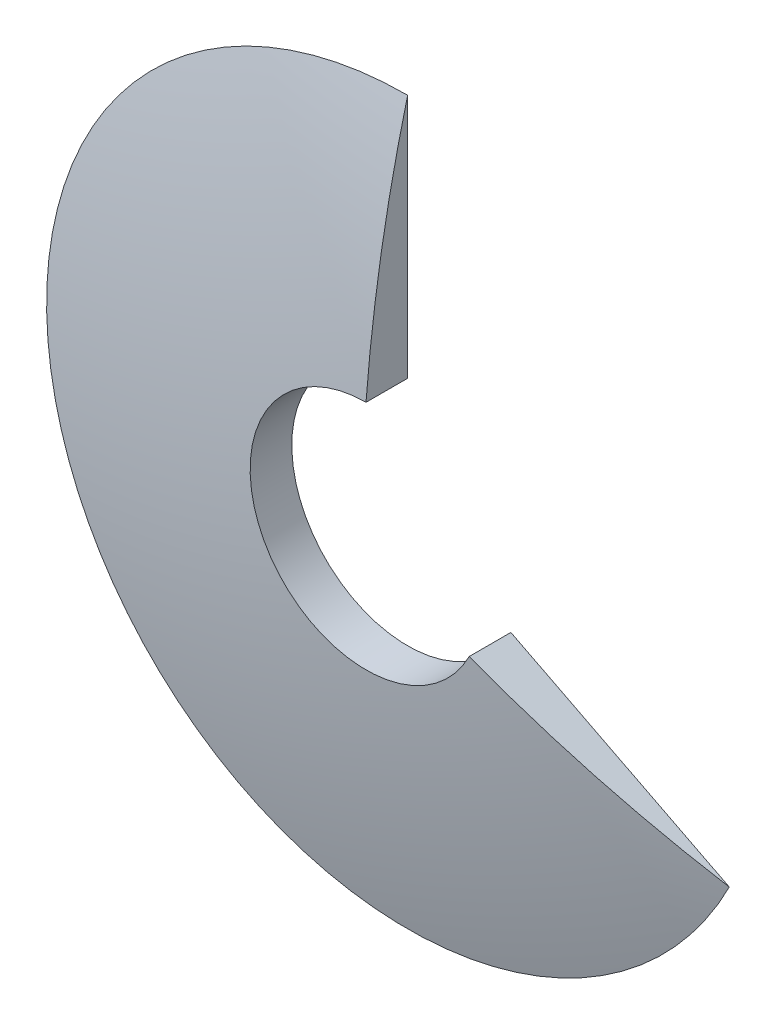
from build123d import *

# Parameters (mm, degrees)
SKICA1_R                 = 77.9
SKICA1_R_2               = 25
P_IDAT_VYSUNUT_M1_DEPTH  = 10
M_TKO1_SCALE             = 0.655
ODEBRAT_VYSUNUT_M1_DEPTH = 73.399138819


with BuildPart() as part:
    # Skica1 → P_idat vysunut_m1 (new body)
    with BuildSketch(Plane.XY):
        Circle(SKICA1_R)
        Circle(SKICA1_R_2, mode=Mode.SUBTRACT)
    extrude(amount=P_IDAT_VYSUNUT_M1_DEPTH)

    # Skica2 → Odebrat rotac_2 (revolve, cut)
    with BuildSketch(Plane(origin=(0, 0, 0), x_dir=(0, 0, -1), z_dir=(1, 0, 0))):
        with BuildLine():
            Line((-10, 0), (-24.202698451, 0))
            Line((-24.202698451, 0), (-24.202698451, 77.9))
            Line((-24.202698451, 77.9), (0, 77.9))
            ThreePointArc((0, 77.9), (-7.489784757, 39.269612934), (-10, 0))
        make_face()
    revolve(axis=Axis((0, 0, 10), (0, 0, 1)), mode=Mode.SUBTRACT)


with BuildPart() as part_1:
    # M_tko1: scaled about (0, 0, 0)
    add(part.part.scale(M_TKO1_SCALE))

    # Skica3 → Odebrat vysunut_m1 (cut, through all)
    with BuildSketch(Plane.XY):
        with BuildLine():
            Line((0, 60.661697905), (0, 0))
            Line((0, 0), (54.049968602, -27.539834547))
            ThreePointArc((54.049968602, -27.539834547), (58.985610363, -14.16119214), (60.661697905, 0))
            ThreePointArc((60.661697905, 0), (42.894297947, 42.894297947), (0, 60.661697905))
        make_face()
    extrude(amount=ODEBRAT_VYSUNUT_M1_DEPTH, mode=Mode.SUBTRACT)


solid = part_1.part
